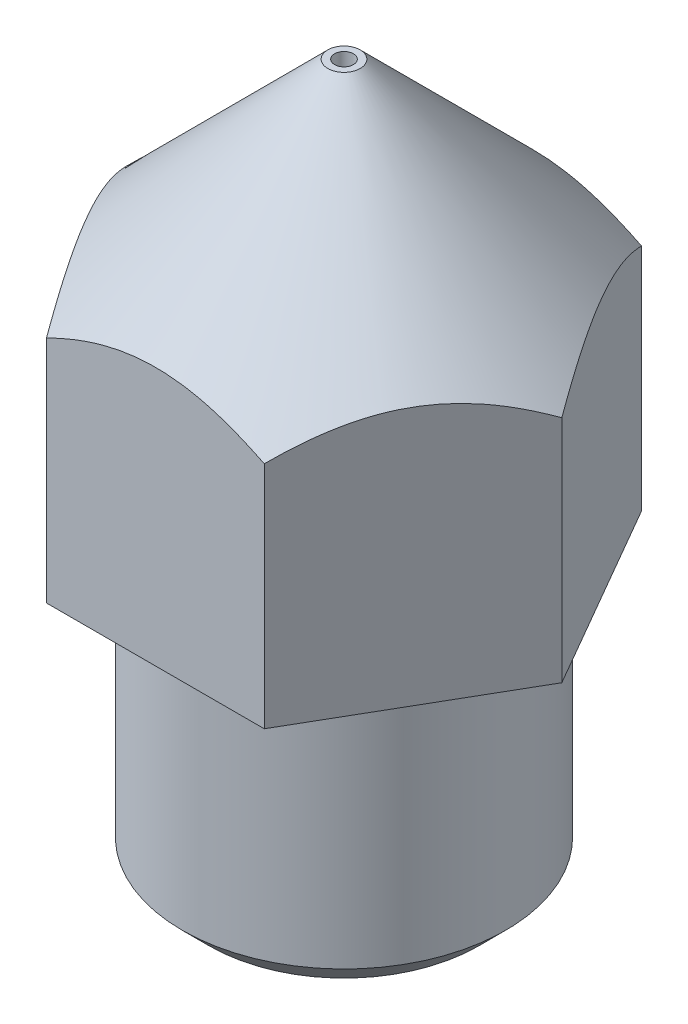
ISO-10303-21;
HEADER;
FILE_DESCRIPTION(('STEP AP214'),'2;1');
FILE_NAME('part.step','',(''),(''),'','','');
FILE_SCHEMA(('AUTOMOTIVE_DESIGN { 1 0 10303 214 1 1 1 1 }'));
ENDSEC;
DATA;
#1=APPLICATION_CONTEXT('core data for automotive mechanical design processes');
#2=APPLICATION_PROTOCOL_DEFINITION('international standard','automotive_design',2000,#1);
#3=PRODUCT_CONTEXT('',#1,'mechanical');
#4=PRODUCT('Part','Part','',(#3));
#5=PRODUCT_RELATED_PRODUCT_CATEGORY('part','',(#4));
#6=PRODUCT_DEFINITION_FORMATION('','',#4);
#7=PRODUCT_DEFINITION_CONTEXT('part definition',#1,'design');
#8=PRODUCT_DEFINITION('design','',#6,#7);
#9=PRODUCT_DEFINITION_SHAPE('','',#8);
#10=(LENGTH_UNIT() NAMED_UNIT(*) SI_UNIT(.MILLI.,.METRE.));
#11=(NAMED_UNIT(*) PLANE_ANGLE_UNIT() SI_UNIT($,.RADIAN.));
#12=(NAMED_UNIT(*) SI_UNIT($,.STERADIAN.) SOLID_ANGLE_UNIT());
#13=UNCERTAINTY_MEASURE_WITH_UNIT(LENGTH_MEASURE(1.E-05),#10,'distance_accuracy_value','');
#14=(GEOMETRIC_REPRESENTATION_CONTEXT(3) GLOBAL_UNCERTAINTY_ASSIGNED_CONTEXT((#13)) GLOBAL_UNIT_ASSIGNED_CONTEXT((#10,
#11,#12)) REPRESENTATION_CONTEXT('',''));
#15=CARTESIAN_POINT('',(0.,0.,0.));
#16=DIRECTION('',(0.,0.,1.));
#17=DIRECTION('',(1.,0.,0.));
#18=AXIS2_PLACEMENT_3D('',#15,#16,#17);
#19=CARTESIAN_POINT('',(0.,13.,0.));
#20=DIRECTION('',(0.,1.,0.));
#21=DIRECTION('',(0.,0.,1.));
#22=AXIS2_PLACEMENT_3D('',#19,#20,#21);
#23=PLANE('',#22);
#24=CARTESIAN_POINT('',(0.,13.,0.));
#25=DIRECTION('',(0.,-1.,0.));
#26=DIRECTION('',(0.,0.,-1.));
#27=AXIS2_PLACEMENT_3D('',#24,#25,#26);
#28=CIRCLE('',#27,0.3);
#29=CARTESIAN_POINT('',(0.,13.,-0.3));
#30=VERTEX_POINT('',#29);
#31=EDGE_CURVE('E196',#30,#30,#28,.T.);
#32=ORIENTED_EDGE('',*,*,#31,.F.);
#33=EDGE_LOOP('',(#32));
#34=FACE_BOUND('',#33,.T.);
#35=CARTESIAN_POINT('',(0.,13.,0.));
#36=DIRECTION('',(0.,1.,0.));
#37=DIRECTION('',(0.,0.,1.));
#38=AXIS2_PLACEMENT_3D('',#35,#36,#37);
#39=CIRCLE('',#38,0.175);
#40=CARTESIAN_POINT('',(0.,13.,0.175));
#41=VERTEX_POINT('',#40);
#42=EDGE_CURVE('E199',#41,#41,#39,.T.);
#43=ORIENTED_EDGE('',*,*,#42,.F.);
#44=EDGE_LOOP('',(#43));
#45=FACE_BOUND('',#44,.T.);
#46=ADVANCED_FACE('F35',(#34,#45),#23,.T.);
#47=CARTESIAN_POINT('',(0.,0.,0.));
#48=DIRECTION('',(0.,1.,0.));
#49=DIRECTION('',(0.,0.,1.));
#50=AXIS2_PLACEMENT_3D('',#47,#48,#49);
#51=PLANE('',#50);
#52=CARTESIAN_POINT('',(0.,0.,0.));
#53=DIRECTION('',(0.,1.,0.));
#54=DIRECTION('',(0.,0.,1.));
#55=AXIS2_PLACEMENT_3D('',#52,#53,#54);
#56=CIRCLE('',#55,2.5);
#57=CARTESIAN_POINT('',(0.,0.,2.5));
#58=VERTEX_POINT('',#57);
#59=EDGE_CURVE('E212',#58,#58,#56,.T.);
#60=ORIENTED_EDGE('',*,*,#59,.F.);
#61=EDGE_LOOP('',(#60));
#62=FACE_BOUND('',#61,.T.);
#63=CARTESIAN_POINT('',(0.,0.,0.));
#64=DIRECTION('',(0.,1.,0.));
#65=DIRECTION('',(0.,0.,1.));
#66=AXIS2_PLACEMENT_3D('',#63,#64,#65);
#67=CIRCLE('',#66,1.25);
#68=CARTESIAN_POINT('',(0.,0.,1.25));
#69=VERTEX_POINT('',#68);
#70=EDGE_CURVE('E209',#69,#69,#67,.T.);
#71=ORIENTED_EDGE('',*,*,#70,.T.);
#72=EDGE_LOOP('',(#71));
#73=FACE_BOUND('',#72,.T.);
#74=ADVANCED_FACE('F187',(#62,#73),#51,.F.);
#75=CARTESIAN_POINT('',(0.,5.,0.));
#76=DIRECTION('',(0.,-1.,0.));
#77=DIRECTION('',(0.,0.,-1.));
#78=AXIS2_PLACEMENT_3D('',#75,#76,#77);
#79=CYLINDRICAL_SURFACE('',#78,3.);
#80=CARTESIAN_POINT('',(0.,5.,0.));
#81=DIRECTION('',(0.,1.,0.));
#82=DIRECTION('',(0.,0.,1.));
#83=AXIS2_PLACEMENT_3D('',#80,#81,#82);
#84=CIRCLE('',#83,3.);
#85=CARTESIAN_POINT('',(0.,5.,3.));
#86=VERTEX_POINT('',#85);
#87=EDGE_CURVE('E11',#86,#86,#84,.T.);
#88=ORIENTED_EDGE('',*,*,#87,.F.);
#89=EDGE_LOOP('',(#88));
#90=FACE_BOUND('',#89,.T.);
#91=CARTESIAN_POINT('',(0.,0.5,0.));
#92=DIRECTION('',(0.,1.,0.));
#93=DIRECTION('',(0.,0.,1.));
#94=AXIS2_PLACEMENT_3D('',#91,#92,#93);
#95=CIRCLE('',#94,3.);
#96=CARTESIAN_POINT('',(0.,0.5,3.));
#97=VERTEX_POINT('',#96);
#98=EDGE_CURVE('E215',#97,#97,#95,.T.);
#99=ORIENTED_EDGE('',*,*,#98,.T.);
#100=EDGE_LOOP('',(#99));
#101=FACE_BOUND('',#100,.T.);
#102=ADVANCED_FACE('F37',(#90,#101),#79,.T.);
#103=CARTESIAN_POINT('',(0.,5.,0.));
#104=DIRECTION('',(0.,1.,0.));
#105=DIRECTION('',(0.,0.,1.));
#106=AXIS2_PLACEMENT_3D('',#103,#104,#105);
#107=PLANE('',#106);
#108=DIRECTION('',(-0.5,0.,-0.866025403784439));
#109=VECTOR('',#108,1.);
#110=CARTESIAN_POINT('',(4.04145188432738,5.,0.));
#111=LINE('',#110,#109);
#112=CARTESIAN_POINT('',(4.04145188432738,5.,0.));
#113=VERTEX_POINT('',#112);
#114=CARTESIAN_POINT('',(2.02072594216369,5.,-3.5));
#115=VERTEX_POINT('',#114);
#116=EDGE_CURVE('E94',#113,#115,#111,.T.);
#117=ORIENTED_EDGE('',*,*,#116,.F.);
#118=DIRECTION('',(0.5,0.,-0.866025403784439));
#119=VECTOR('',#118,1.);
#120=CARTESIAN_POINT('',(2.02072594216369,5.,3.5));
#121=LINE('',#120,#119);
#122=CARTESIAN_POINT('',(2.02072594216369,5.,3.5));
#123=VERTEX_POINT('',#122);
#124=EDGE_CURVE('E115',#123,#113,#121,.T.);
#125=ORIENTED_EDGE('',*,*,#124,.F.);
#126=DIRECTION('',(1.,0.,0.));
#127=VECTOR('',#126,1.);
#128=CARTESIAN_POINT('',(-2.02072594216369,5.,3.5));
#129=LINE('',#128,#127);
#130=CARTESIAN_POINT('',(-2.02072594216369,5.,3.5));
#131=VERTEX_POINT('',#130);
#132=EDGE_CURVE('E117',#131,#123,#129,.T.);
#133=ORIENTED_EDGE('',*,*,#132,.F.);
#134=DIRECTION('',(0.5,0.,0.866025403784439));
#135=VECTOR('',#134,1.);
#136=CARTESIAN_POINT('',(-4.04145188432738,5.,0.));
#137=LINE('',#136,#135);
#138=CARTESIAN_POINT('',(-4.04145188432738,5.,0.));
#139=VERTEX_POINT('',#138);
#140=EDGE_CURVE('E120',#139,#131,#137,.T.);
#141=ORIENTED_EDGE('',*,*,#140,.F.);
#142=DIRECTION('',(-0.5,0.,0.866025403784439));
#143=VECTOR('',#142,1.);
#144=CARTESIAN_POINT('',(-2.02072594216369,5.,-3.5));
#145=LINE('',#144,#143);
#146=CARTESIAN_POINT('',(-2.02072594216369,5.,-3.5));
#147=VERTEX_POINT('',#146);
#148=EDGE_CURVE('E123',#147,#139,#145,.T.);
#149=ORIENTED_EDGE('',*,*,#148,.F.);
#150=DIRECTION('',(-1.,0.,0.));
#151=VECTOR('',#150,1.);
#152=CARTESIAN_POINT('',(2.02072594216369,5.,-3.5));
#153=LINE('',#152,#151);
#154=EDGE_CURVE('E126',#115,#147,#153,.T.);
#155=ORIENTED_EDGE('',*,*,#154,.F.);
#156=EDGE_LOOP('',(#117,#125,#133,#141,#149,#155));
#157=FACE_BOUND('',#156,.T.);
#158=ORIENTED_EDGE('',*,*,#87,.T.);
#159=EDGE_LOOP('',(#158));
#160=FACE_BOUND('',#159,.T.);
#161=ADVANCED_FACE('F185',(#157,#160),#107,.F.);
#162=CARTESIAN_POINT('',(4.04145188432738,13.,0.));
#163=DIRECTION('',(-0.866025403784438,0.,0.5));
#164=DIRECTION('',(0.5,0.,0.866025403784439));
#165=AXIS2_PLACEMENT_3D('',#162,#163,#164);
#166=PLANE('',#165);
#167=DIRECTION('',(0.,-1.,0.));
#168=VECTOR('',#167,1.);
#169=CARTESIAN_POINT('',(2.02072594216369,13.,-3.5));
#170=LINE('',#169,#168);
#171=CARTESIAN_POINT('',(2.02072594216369,9.25854811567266,-3.5));
#172=VERTEX_POINT('',#171);
#173=EDGE_CURVE('E43',#172,#115,#170,.T.);
#174=ORIENTED_EDGE('',*,*,#173,.F.);
#175=CARTESIAN_POINT('',(2.02061047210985,9.25843264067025,-3.5002));
#176=CARTESIAN_POINT('',(2.09007076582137,9.32783218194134,-3.37989124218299));
#177=CARTESIAN_POINT('',(2.16069251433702,9.39315563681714,-3.25757078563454));
#178=CARTESIAN_POINT('',(2.30469791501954,9.51276106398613,-3.00814611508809));
#179=CARTESIAN_POINT('',(2.37809526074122,9.56697649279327,-2.88101818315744));
#180=CARTESIAN_POINT('',(2.52609746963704,9.65984844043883,-2.62467083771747));
#181=CARTESIAN_POINT('',(2.60066464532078,9.69873837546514,-2.49551670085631));
#182=CARTESIAN_POINT('',(2.75144053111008,9.75865621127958,-2.23436520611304));
#183=CARTESIAN_POINT('',(2.82764463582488,9.77972883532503,-2.10237582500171));
#184=CARTESIAN_POINT('',(2.95898000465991,9.79874200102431,-1.87489629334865));
#185=CARTESIAN_POINT('',(3.01394167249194,9.80155641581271,-1.77969989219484));
#186=CARTESIAN_POINT('',(3.12377560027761,9.79681342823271,-1.58946194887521));
#187=CARTESIAN_POINT('',(3.17864782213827,9.78925238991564,-1.49442047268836));
#188=CARTESIAN_POINT('',(3.28787240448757,9.76419021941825,-1.30523794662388));
#189=CARTESIAN_POINT('',(3.3422241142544,9.74667796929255,-1.21109802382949));
#190=CARTESIAN_POINT('',(3.44999406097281,9.70266921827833,-1.02443500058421));
#191=CARTESIAN_POINT('',(3.50341236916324,9.67617340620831,-0.931911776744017));
#192=CARTESIAN_POINT('',(3.59824414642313,9.62166014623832,-0.767658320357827));
#193=CARTESIAN_POINT('',(3.63986754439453,9.59507581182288,-0.695564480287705));
#194=CARTESIAN_POINT('',(3.72236709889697,9.53762274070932,-0.552671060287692));
#195=CARTESIAN_POINT('',(3.76324323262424,9.50675387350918,-0.481871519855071));
#196=CARTESIAN_POINT('',(3.84411947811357,9.44142377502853,-0.341789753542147));
#197=CARTESIAN_POINT('',(3.88412189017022,9.40697384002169,-0.272503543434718));
#198=CARTESIAN_POINT('',(3.96338588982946,9.33493401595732,-0.135214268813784));
#199=CARTESIAN_POINT('',(4.00264791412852,9.29734605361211,-0.0672104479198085));
#200=CARTESIAN_POINT('',(4.04156735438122,9.25843264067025,0.000200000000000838));
#201=B_SPLINE_CURVE_WITH_KNOTS('',3,(#175,#176,#177,#178,#179,#180,#181,#182,#183,#184,#185,
#186,#187,#188,#189,#190,#191,#192,#193,#194,#195,#196,#197,#198,#199,#200),.UNSPECIFIED.,.F.,
.F.,(4,2,2,2,2,2,2,2,2,2,2,2,4),(0.,0.466195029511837,0.93510605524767,1.39657035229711,
1.85687285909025,2.18628459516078,2.51581179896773,2.84570789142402,3.17557869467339,
3.4376213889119,3.69967206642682,3.96091985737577,4.22200840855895),.UNSPECIFIED.);
#202=CARTESIAN_POINT('',(4.04145188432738,9.25854811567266,0.));
#203=VERTEX_POINT('',#202);
#204=EDGE_CURVE('E87',#172,#203,#201,.T.);
#205=ORIENTED_EDGE('',*,*,#204,.T.);
#206=DIRECTION('',(0.,-1.,0.));
#207=VECTOR('',#206,1.);
#208=CARTESIAN_POINT('',(4.04145188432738,13.,0.));
#209=LINE('',#208,#207);
#210=EDGE_CURVE('E58',#203,#113,#209,.T.);
#211=ORIENTED_EDGE('',*,*,#210,.T.);
#212=ORIENTED_EDGE('',*,*,#116,.T.);
#213=EDGE_LOOP('',(#174,#205,#211,#212));
#214=FACE_BOUND('',#213,.T.);
#215=ADVANCED_FACE('F104',(#214),#166,.F.);
#216=CARTESIAN_POINT('',(2.02072594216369,13.,-3.5));
#217=DIRECTION('',(0.,0.,1.));
#218=DIRECTION('',(1.,0.,0.));
#219=AXIS2_PLACEMENT_3D('',#216,#217,#218);
#220=PLANE('',#219);
#221=DIRECTION('',(0.,-1.,0.));
#222=VECTOR('',#221,1.);
#223=CARTESIAN_POINT('',(-2.02072594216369,13.,-3.5));
#224=LINE('',#223,#222);
#225=CARTESIAN_POINT('',(-2.02072594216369,9.25854811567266,-3.5));
#226=VERTEX_POINT('',#225);
#227=EDGE_CURVE('E101',#226,#147,#224,.T.);
#228=ORIENTED_EDGE('',*,*,#227,.F.);
#229=CARTESIAN_POINT('',(-4.05974024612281,7.9398236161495,-3.5));
#230=CARTESIAN_POINT('',(-3.96102227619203,8.01457458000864,-3.5));
#231=CARTESIAN_POINT('',(-3.861754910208,8.08861173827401,-3.5));
#232=CARTESIAN_POINT('',(-3.6619033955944,8.2349377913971,-3.5));
#233=CARTESIAN_POINT('',(-3.56131892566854,8.30722624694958,-3.5));
#234=CARTESIAN_POINT('',(-3.35787936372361,8.45024842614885,-3.5));
#235=CARTESIAN_POINT('',(-3.25501271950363,8.52096577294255,-3.5));
#236=CARTESIAN_POINT('',(-3.04753856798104,8.65979048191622,-3.5));
#237=CARTESIAN_POINT('',(-2.94293118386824,8.72789802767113,-3.5));
#238=CARTESIAN_POINT('',(-2.72555527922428,8.86478741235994,-3.5));
#239=CARTESIAN_POINT('',(-2.61266586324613,8.93337824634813,-3.5));
#240=CARTESIAN_POINT('',(-2.38424886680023,9.06608939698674,-3.5));
#241=CARTESIAN_POINT('',(-2.26872086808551,9.13020899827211,-3.5));
#242=CARTESIAN_POINT('',(-2.03503065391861,9.25259701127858,-3.5));
#243=CARTESIAN_POINT('',(-1.91687751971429,9.31088262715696,-3.5));
#244=CARTESIAN_POINT('',(-1.67732949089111,9.42029763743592,-3.5));
#245=CARTESIAN_POINT('',(-1.55593610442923,9.47143029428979,-3.5));
#246=CARTESIAN_POINT('',(-1.31999119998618,9.56081801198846,-3.5));
#247=CARTESIAN_POINT('',(-1.20571483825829,9.59979186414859,-3.5));
#248=CARTESIAN_POINT('',(-0.974384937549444,9.66857564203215,-3.5));
#249=CARTESIAN_POINT('',(-0.857331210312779,9.69838494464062,-3.5));
#250=CARTESIAN_POINT('',(-0.623106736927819,9.74677811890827,-3.5));
#251=CARTESIAN_POINT('',(-0.505976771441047,9.76555613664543,-3.5));
#252=CARTESIAN_POINT('',(-0.270432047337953,9.7915175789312,-3.5));
#253=CARTESIAN_POINT('',(-0.152017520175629,9.79870305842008,-3.5));
#254=CARTESIAN_POINT('',(0.0805018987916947,9.8009330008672,-3.5));
#255=CARTESIAN_POINT('',(0.194602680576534,9.79642060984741,-3.5));
#256=CARTESIAN_POINT('',(0.421841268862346,9.77648873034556,-3.5));
#257=CARTESIAN_POINT('',(0.534978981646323,9.76106819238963,-3.5));
#258=CARTESIAN_POINT('',(0.761385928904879,9.71990393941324,-3.5));
#259=CARTESIAN_POINT('',(0.874622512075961,9.6939835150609,-3.5));
#260=CARTESIAN_POINT('',(1.09862460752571,9.63321068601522,-3.5));
#261=CARTESIAN_POINT('',(1.20939031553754,9.59835899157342,-3.5));
#262=CARTESIAN_POINT('',(1.43782078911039,9.51781544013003,-3.5));
#263=CARTESIAN_POINT('',(1.55524294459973,9.47144257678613,-3.5));
#264=CARTESIAN_POINT('',(1.78702734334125,9.37157536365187,-3.5));
#265=CARTESIAN_POINT('',(1.90138855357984,9.31807864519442,-3.5));
#266=CARTESIAN_POINT('',(2.12762999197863,9.20522708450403,-3.5));
#267=CARTESIAN_POINT('',(2.23950081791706,9.14585354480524,-3.5));
#268=CARTESIAN_POINT('',(2.46067005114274,9.02256260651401,-3.5));
#269=CARTESIAN_POINT('',(2.56996886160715,8.95864592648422,-3.5));
#270=CARTESIAN_POINT('',(2.78095980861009,8.83042795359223,-3.5));
#271=CARTESIAN_POINT('',(2.8827600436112,8.7663036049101,-3.5));
#272=CARTESIAN_POINT('',(3.08461256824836,8.63535220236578,-3.5));
#273=CARTESIAN_POINT('',(3.18466472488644,8.56852494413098,-3.5));
#274=CARTESIAN_POINT('',(3.38243971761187,8.43320122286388,-3.5));
#275=CARTESIAN_POINT('',(3.48017486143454,8.36472268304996,-3.5));
#276=CARTESIAN_POINT('',(3.67430850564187,8.22595005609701,-3.5));
#277=CARTESIAN_POINT('',(3.77070736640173,8.15565647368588,-3.5));
#278=CARTESIAN_POINT('',(3.86654647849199,8.08462065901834,-3.5));
#279=B_SPLINE_CURVE_WITH_KNOTS('',3,(#229,#230,#231,#232,#233,#234,#235,#236,#237,#238,#239,
#240,#241,#242,#243,#244,#245,#246,#247,#248,#249,#250,#251,#252,#253,#254,#255,#256,#257,#258,
#259,#260,#261,#262,#263,#264,#265,#266,#267,#268,#269,#270,#271,#272,#273,#274,#275,#276,#277,
#278),.UNSPECIFIED.,.F.,.F.,(4,2,2,2,2,2,2,2,2,2,2,2,2,2,2,2,2,2,2,2,2,2,2,2,4),(0.,
0.371486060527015,0.743064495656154,1.11752069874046,1.49195051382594,1.88814901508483,
2.284410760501,2.67946720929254,3.0743428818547,3.4362444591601,3.79817063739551,
4.1535198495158,4.50880606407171,4.85083143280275,5.19288971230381,5.5409611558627,
5.88900492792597,6.2674530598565,6.64602734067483,7.02584735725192,7.40560743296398,
7.76649630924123,8.12741252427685,8.48540294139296,8.84329485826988),.UNSPECIFIED.);
#280=EDGE_CURVE('E90',#226,#172,#279,.T.);
#281=ORIENTED_EDGE('',*,*,#280,.T.);
#282=ORIENTED_EDGE('',*,*,#173,.T.);
#283=ORIENTED_EDGE('',*,*,#154,.T.);
#284=EDGE_LOOP('',(#228,#281,#282,#283));
#285=FACE_BOUND('',#284,.T.);
#286=ADVANCED_FACE('F98',(#285),#220,.F.);
#287=CARTESIAN_POINT('',(-2.02072594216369,13.,-3.5));
#288=DIRECTION('',(0.866025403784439,0.,0.5));
#289=DIRECTION('',(0.5,0.,-0.866025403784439));
#290=AXIS2_PLACEMENT_3D('',#287,#288,#289);
#291=PLANE('',#290);
#292=DIRECTION('',(0.,-1.,0.));
#293=VECTOR('',#292,1.);
#294=CARTESIAN_POINT('',(-4.04145188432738,13.,0.));
#295=LINE('',#294,#293);
#296=CARTESIAN_POINT('',(-4.04145188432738,9.25854811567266,0.));
#297=VERTEX_POINT('',#296);
#298=EDGE_CURVE('E106',#297,#139,#295,.T.);
#299=ORIENTED_EDGE('',*,*,#298,.F.);
#300=CARTESIAN_POINT('',(-4.04156735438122,9.25843264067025,0.000199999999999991));
#301=CARTESIAN_POINT('',(-3.9721070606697,9.32783218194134,-0.12010875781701));
#302=CARTESIAN_POINT('',(-3.90148531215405,9.39315563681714,-0.24242921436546));
#303=CARTESIAN_POINT('',(-3.75747991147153,9.51276106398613,-0.49185388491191));
#304=CARTESIAN_POINT('',(-3.68408256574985,9.56697649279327,-0.618981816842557));
#305=CARTESIAN_POINT('',(-3.53608035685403,9.65984844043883,-0.875329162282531));
#306=CARTESIAN_POINT('',(-3.46151318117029,9.69873837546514,-1.00448329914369));
#307=CARTESIAN_POINT('',(-3.31073729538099,9.75865621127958,-1.26563479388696));
#308=CARTESIAN_POINT('',(-3.23453319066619,9.77972883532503,-1.39762417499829));
#309=CARTESIAN_POINT('',(-3.10319782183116,9.79874200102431,-1.62510370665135));
#310=CARTESIAN_POINT('',(-3.04823615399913,9.80155641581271,-1.72030010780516));
#311=CARTESIAN_POINT('',(-2.93840222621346,9.79681342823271,-1.91053805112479));
#312=CARTESIAN_POINT('',(-2.88353000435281,9.78925238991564,-2.00557952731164));
#313=CARTESIAN_POINT('',(-2.77430542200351,9.76419021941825,-2.19476205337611));
#314=CARTESIAN_POINT('',(-2.71995371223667,9.74667796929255,-2.28890197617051));
#315=CARTESIAN_POINT('',(-2.61218376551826,9.70266921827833,-2.47556499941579));
#316=CARTESIAN_POINT('',(-2.55876545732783,9.6761734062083,-2.56808822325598));
#317=CARTESIAN_POINT('',(-2.46393368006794,9.62166014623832,-2.73234167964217));
#318=CARTESIAN_POINT('',(-2.42231028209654,9.59507581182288,-2.8044355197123));
#319=CARTESIAN_POINT('',(-2.33981072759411,9.53762274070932,-2.94732893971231));
#320=CARTESIAN_POINT('',(-2.29893459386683,9.50675387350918,-3.01812848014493));
#321=CARTESIAN_POINT('',(-2.21805834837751,9.44142377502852,-3.15821024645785));
#322=CARTESIAN_POINT('',(-2.17805593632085,9.40697384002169,-3.22749645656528));
#323=CARTESIAN_POINT('',(-2.09879193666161,9.33493401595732,-3.36478573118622));
#324=CARTESIAN_POINT('',(-2.05952991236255,9.29734605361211,-3.43278955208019));
#325=CARTESIAN_POINT('',(-2.02061047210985,9.25843264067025,-3.5002));
#326=B_SPLINE_CURVE_WITH_KNOTS('',3,(#300,#301,#302,#303,#304,#305,#306,#307,#308,#309,#310,
#311,#312,#313,#314,#315,#316,#317,#318,#319,#320,#321,#322,#323,#324,#325),.UNSPECIFIED.,.F.,
.F.,(4,2,2,2,2,2,2,2,2,2,2,2,4),(0.,0.466195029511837,0.935106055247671,1.39657035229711,
1.85687285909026,2.18628459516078,2.51581179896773,2.84570789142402,3.17557869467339,
3.4376213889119,3.69967206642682,3.96091985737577,4.22200840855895),.UNSPECIFIED.);
#327=EDGE_CURVE('E102',#297,#226,#326,.T.);
#328=ORIENTED_EDGE('',*,*,#327,.T.);
#329=ORIENTED_EDGE('',*,*,#227,.T.);
#330=ORIENTED_EDGE('',*,*,#148,.T.);
#331=EDGE_LOOP('',(#299,#328,#329,#330));
#332=FACE_BOUND('',#331,.T.);
#333=ADVANCED_FACE('F174',(#332),#291,.F.);
#334=CARTESIAN_POINT('',(-4.04145188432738,13.,0.));
#335=DIRECTION('',(0.866025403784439,0.,-0.5));
#336=DIRECTION('',(-0.5,0.,-0.866025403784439));
#337=AXIS2_PLACEMENT_3D('',#334,#335,#336);
#338=PLANE('',#337);
#339=DIRECTION('',(0.,-1.,0.));
#340=VECTOR('',#339,1.);
#341=CARTESIAN_POINT('',(-2.02072594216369,13.,3.5));
#342=LINE('',#341,#340);
#343=CARTESIAN_POINT('',(-2.02072594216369,9.25854811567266,3.5));
#344=VERTEX_POINT('',#343);
#345=EDGE_CURVE('E110',#344,#131,#342,.T.);
#346=ORIENTED_EDGE('',*,*,#345,.F.);
#347=CARTESIAN_POINT('',(-2.02061047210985,9.25843264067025,3.5002));
#348=CARTESIAN_POINT('',(-2.09007076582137,9.32783218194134,3.37989124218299));
#349=CARTESIAN_POINT('',(-2.16069251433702,9.39315563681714,3.25757078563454));
#350=CARTESIAN_POINT('',(-2.30469791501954,9.51276106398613,3.00814611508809));
#351=CARTESIAN_POINT('',(-2.37809526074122,9.56697649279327,2.88101818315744));
#352=CARTESIAN_POINT('',(-2.52609746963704,9.65984844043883,2.62467083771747));
#353=CARTESIAN_POINT('',(-2.60066464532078,9.69873837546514,2.49551670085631));
#354=CARTESIAN_POINT('',(-2.75144053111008,9.75865621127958,2.23436520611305));
#355=CARTESIAN_POINT('',(-2.82764463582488,9.77972883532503,2.10237582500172));
#356=CARTESIAN_POINT('',(-2.95898000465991,9.79874200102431,1.87489629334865));
#357=CARTESIAN_POINT('',(-3.01394167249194,9.80155641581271,1.77969989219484));
#358=CARTESIAN_POINT('',(-3.12377560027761,9.79681342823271,1.58946194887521));
#359=CARTESIAN_POINT('',(-3.17864782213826,9.78925238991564,1.49442047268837));
#360=CARTESIAN_POINT('',(-3.28787240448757,9.76419021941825,1.30523794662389));
#361=CARTESIAN_POINT('',(-3.3422241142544,9.74667796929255,1.21109802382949));
#362=CARTESIAN_POINT('',(-3.44999406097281,9.70266921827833,1.02443500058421));
#363=CARTESIAN_POINT('',(-3.50341236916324,9.6761734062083,0.93191177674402));
#364=CARTESIAN_POINT('',(-3.59824414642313,9.62166014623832,0.767658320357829));
#365=CARTESIAN_POINT('',(-3.63986754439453,9.59507581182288,0.695564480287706));
#366=CARTESIAN_POINT('',(-3.72236709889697,9.53762274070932,0.552671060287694));
#367=CARTESIAN_POINT('',(-3.76324323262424,9.50675387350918,0.481871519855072));
#368=CARTESIAN_POINT('',(-3.84411947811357,9.44142377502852,0.341789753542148));
#369=CARTESIAN_POINT('',(-3.88412189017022,9.40697384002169,0.27250354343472));
#370=CARTESIAN_POINT('',(-3.96338588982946,9.33493401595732,0.135214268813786));
#371=CARTESIAN_POINT('',(-4.00264791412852,9.29734605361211,0.0672104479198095));
#372=CARTESIAN_POINT('',(-4.04156735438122,9.25843264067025,-0.00020000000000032));
#373=B_SPLINE_CURVE_WITH_KNOTS('',3,(#347,#348,#349,#350,#351,#352,#353,#354,#355,#356,#357,
#358,#359,#360,#361,#362,#363,#364,#365,#366,#367,#368,#369,#370,#371,#372),.UNSPECIFIED.,.F.,
.F.,(4,2,2,2,2,2,2,2,2,2,2,2,4),(0.,0.466195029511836,0.93510605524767,1.3965703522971,
1.85687285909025,2.18628459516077,2.51581179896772,2.84570789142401,3.17557869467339,
3.4376213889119,3.69967206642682,3.96091985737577,4.22200840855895),.UNSPECIFIED.);
#374=EDGE_CURVE('E165',#344,#297,#373,.T.);
#375=ORIENTED_EDGE('',*,*,#374,.T.);
#376=ORIENTED_EDGE('',*,*,#298,.T.);
#377=ORIENTED_EDGE('',*,*,#140,.T.);
#378=EDGE_LOOP('',(#346,#375,#376,#377));
#379=FACE_BOUND('',#378,.T.);
#380=ADVANCED_FACE('F177',(#379),#338,.F.);
#381=CARTESIAN_POINT('',(-2.02072594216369,13.,3.5));
#382=DIRECTION('',(0.,0.,-1.));
#383=DIRECTION('',(-1.,0.,0.));
#384=AXIS2_PLACEMENT_3D('',#381,#382,#383);
#385=PLANE('',#384);
#386=DIRECTION('',(0.,-1.,0.));
#387=VECTOR('',#386,1.);
#388=CARTESIAN_POINT('',(2.02072594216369,13.,3.5));
#389=LINE('',#388,#387);
#390=CARTESIAN_POINT('',(2.02072594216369,9.25854811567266,3.5));
#391=VERTEX_POINT('',#390);
#392=EDGE_CURVE('E112',#391,#123,#389,.T.);
#393=ORIENTED_EDGE('',*,*,#392,.F.);
#394=CARTESIAN_POINT('',(-4.05974024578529,7.93982361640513,3.5));
#395=CARTESIAN_POINT('',(-3.96102227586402,8.01457458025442,3.5));
#396=CARTESIAN_POINT('',(-3.86175490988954,8.08861173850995,3.5));
#397=CARTESIAN_POINT('',(-3.66190339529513,8.23493779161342,3.5));
#398=CARTESIAN_POINT('',(-3.56131892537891,8.30722624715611,3.5));
#399=CARTESIAN_POINT('',(-3.35787936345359,8.45024842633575,3.5));
#400=CARTESIAN_POINT('',(-3.25501271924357,8.5209657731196,3.5));
#401=CARTESIAN_POINT('',(-3.0475385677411,8.65979048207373,3.5));
#402=CARTESIAN_POINT('',(-2.94293118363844,8.72789802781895,3.5));
#403=CARTESIAN_POINT('',(-2.72555527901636,8.86478741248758,3.5));
#404=CARTESIAN_POINT('',(-2.61266586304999,8.93337824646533,3.5));
#405=CARTESIAN_POINT('',(-2.38424886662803,9.06608939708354,3.5));
#406=CARTESIAN_POINT('',(-2.26872086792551,9.13020899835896,3.5));
#407=CARTESIAN_POINT('',(-2.03503065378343,9.25259701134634,3.5));
#408=CARTESIAN_POINT('',(-1.91687751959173,9.31088262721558,3.5));
#409=CARTESIAN_POINT('',(-1.67732949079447,9.42029763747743,3.5));
#410=CARTESIAN_POINT('',(-1.5559361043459,9.4714302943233,3.5));
#411=CARTESIAN_POINT('',(-1.31999119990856,9.56081801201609,3.5));
#412=CARTESIAN_POINT('',(-1.2057148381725,9.59979186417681,3.5));
#413=CARTESIAN_POINT('',(-0.974384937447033,9.6685756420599,3.5));
#414=CARTESIAN_POINT('',(-0.857331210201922,9.69838494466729,3.5));
#415=CARTESIAN_POINT('',(-0.623106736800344,9.7467781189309,3.5));
#416=CARTESIAN_POINT('',(-0.505976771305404,9.76555613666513,3.5));
#417=CARTESIAN_POINT('',(-0.27043204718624,9.79151757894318,3.5));
#418=CARTESIAN_POINT('',(-0.152017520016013,9.79870305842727,3.5));
#419=CARTESIAN_POINT('',(0.0805018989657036,9.80093300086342,3.5));
#420=CARTESIAN_POINT('',(0.194602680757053,9.79642060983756,3.5));
#421=CARTESIAN_POINT('',(0.421841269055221,9.77648873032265,3.5));
#422=CARTESIAN_POINT('',(0.534978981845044,9.76106819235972,3.5));
#423=CARTESIAN_POINT('',(0.761385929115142,9.71990393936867,3.5));
#424=CARTESIAN_POINT('',(0.874622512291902,9.69398351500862,3.5));
#425=CARTESIAN_POINT('',(1.09862460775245,9.63321068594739,3.5));
#426=CARTESIAN_POINT('',(1.2093903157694,9.59835899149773,3.5));
#427=CARTESIAN_POINT('',(1.43782078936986,9.51781544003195,3.5));
#428=CARTESIAN_POINT('',(1.55524294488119,9.47144257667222,3.5));
#429=CARTESIAN_POINT('',(1.78702734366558,9.37157536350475,3.5));
#430=CARTESIAN_POINT('',(1.90138855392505,9.31807864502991,3.5));
#431=CARTESIAN_POINT('',(2.12762999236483,9.20522708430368,3.5));
#432=CARTESIAN_POINT('',(2.23950081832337,9.14585354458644,3.5));
#433=CARTESIAN_POINT('',(2.46067005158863,9.02256260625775,3.5));
#434=CARTESIAN_POINT('',(2.56996886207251,8.95864592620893,3.5));
#435=CARTESIAN_POINT('',(2.78095980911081,8.83042795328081,3.5));
#436=CARTESIAN_POINT('',(2.88276004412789,8.76630360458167,3.5));
#437=CARTESIAN_POINT('',(3.08461256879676,8.63535220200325,3.5));
#438=CARTESIAN_POINT('',(3.18466472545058,8.56852494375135,3.5));
#439=CARTESIAN_POINT('',(3.38243971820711,8.43320122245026,3.5));
#440=CARTESIAN_POINT('',(3.48017486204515,8.36472268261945,3.5));
#441=CARTESIAN_POINT('',(3.6743085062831,8.22595005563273,3.5));
#442=CARTESIAN_POINT('',(3.77070736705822,8.15565647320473,3.5));
#443=CARTESIAN_POINT('',(3.86654647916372,8.08462065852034,3.5));
#444=B_SPLINE_CURVE_WITH_KNOTS('',3,(#394,#395,#396,#397,#398,#399,#400,#401,#402,#403,#404,
#405,#406,#407,#408,#409,#410,#411,#412,#413,#414,#415,#416,#417,#418,#419,#420,#421,#422,#423,
#424,#425,#426,#427,#428,#429,#430,#431,#432,#433,#434,#435,#436,#437,#438,#439,#440,#441,#442,
#443),.UNSPECIFIED.,.F.,.F.,(4,2,2,2,2,2,2,2,2,2,2,2,2,2,2,2,2,2,2,2,2,2,2,2,4),(0.,
0.371486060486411,0.743064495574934,1.11752069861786,1.49195051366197,1.88814901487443,
2.28441076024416,2.67946720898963,3.07434288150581,3.43624445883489,3.79817063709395,
4.1535198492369,4.50880606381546,4.85083143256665,5.19288971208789,5.54096115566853,
5.88900492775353,6.26745305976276,6.64602734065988,7.0258473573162,7.40560743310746,
7.76649630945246,8.12741252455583,8.48540294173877,8.84329485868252),.UNSPECIFIED.);
#445=EDGE_CURVE('E50',#391,#344,#444,.F.);
#446=ORIENTED_EDGE('',*,*,#445,.T.);
#447=ORIENTED_EDGE('',*,*,#345,.T.);
#448=ORIENTED_EDGE('',*,*,#132,.T.);
#449=EDGE_LOOP('',(#393,#446,#447,#448));
#450=FACE_BOUND('',#449,.T.);
#451=ADVANCED_FACE('F230',(#450),#385,.F.);
#452=CARTESIAN_POINT('',(2.02072594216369,13.,3.5));
#453=DIRECTION('',(-0.866025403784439,0.,-0.5));
#454=DIRECTION('',(-0.5,0.,0.866025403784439));
#455=AXIS2_PLACEMENT_3D('',#452,#453,#454);
#456=PLANE('',#455);
#457=ORIENTED_EDGE('',*,*,#210,.F.);
#458=CARTESIAN_POINT('',(4.04156735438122,9.25843264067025,-0.000199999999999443));
#459=CARTESIAN_POINT('',(3.9721070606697,9.32783218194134,0.120108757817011));
#460=CARTESIAN_POINT('',(3.90148531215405,9.39315563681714,0.242429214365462));
#461=CARTESIAN_POINT('',(3.75747991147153,9.51276106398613,0.491853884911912));
#462=CARTESIAN_POINT('',(3.68408256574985,9.56697649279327,0.618981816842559));
#463=CARTESIAN_POINT('',(3.53608035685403,9.65984844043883,0.875329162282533));
#464=CARTESIAN_POINT('',(3.46151318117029,9.69873837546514,1.00448329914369));
#465=CARTESIAN_POINT('',(3.31073729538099,9.75865621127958,1.26563479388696));
#466=CARTESIAN_POINT('',(3.23453319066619,9.77972883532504,1.39762417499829));
#467=CARTESIAN_POINT('',(3.10319782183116,9.79874200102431,1.62510370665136));
#468=CARTESIAN_POINT('',(3.04823615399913,9.80155641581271,1.72030010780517));
#469=CARTESIAN_POINT('',(2.93840222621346,9.79681342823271,1.9105380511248));
#470=CARTESIAN_POINT('',(2.8835300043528,9.78925238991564,2.00557952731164));
#471=CARTESIAN_POINT('',(2.7743054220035,9.76419021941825,2.19476205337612));
#472=CARTESIAN_POINT('',(2.71995371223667,9.74667796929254,2.28890197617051));
#473=CARTESIAN_POINT('',(2.61218376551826,9.70266921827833,2.47556499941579));
#474=CARTESIAN_POINT('',(2.55876545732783,9.6761734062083,2.56808822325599));
#475=CARTESIAN_POINT('',(2.46393368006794,9.62166014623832,2.73234167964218));
#476=CARTESIAN_POINT('',(2.42231028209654,9.59507581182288,2.8044355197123));
#477=CARTESIAN_POINT('',(2.3398107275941,9.53762274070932,2.94732893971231));
#478=CARTESIAN_POINT('',(2.29893459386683,9.50675387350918,3.01812848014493));
#479=CARTESIAN_POINT('',(2.2180583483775,9.44142377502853,3.15821024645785));
#480=CARTESIAN_POINT('',(2.17805593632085,9.40697384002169,3.22749645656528));
#481=CARTESIAN_POINT('',(2.09879193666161,9.33493401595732,3.36478573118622));
#482=CARTESIAN_POINT('',(2.05952991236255,9.29734605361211,3.43278955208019));
#483=CARTESIAN_POINT('',(2.02061047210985,9.25843264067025,3.5002));
#484=B_SPLINE_CURVE_WITH_KNOTS('',3,(#458,#459,#460,#461,#462,#463,#464,#465,#466,#467,#468,
#469,#470,#471,#472,#473,#474,#475,#476,#477,#478,#479,#480,#481,#482,#483),.UNSPECIFIED.,.F.,
.F.,(4,2,2,2,2,2,2,2,2,2,2,2,4),(0.,0.466195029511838,0.935106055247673,1.39657035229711,
1.85687285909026,2.18628459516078,2.51581179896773,2.84570789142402,3.1755786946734,
3.43762138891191,3.69967206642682,3.96091985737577,4.22200840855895),.UNSPECIFIED.);
#485=EDGE_CURVE('E92',#203,#391,#484,.T.);
#486=ORIENTED_EDGE('',*,*,#485,.T.);
#487=ORIENTED_EDGE('',*,*,#392,.T.);
#488=ORIENTED_EDGE('',*,*,#124,.T.);
#489=EDGE_LOOP('',(#457,#486,#487,#488));
#490=FACE_BOUND('',#489,.T.);
#491=ADVANCED_FACE('F144',(#490),#456,.F.);
#492=CARTESIAN_POINT('',(0.,13.,0.));
#493=DIRECTION('',(0.,-1.,0.));
#494=DIRECTION('',(0.,0.,-1.));
#495=AXIS2_PLACEMENT_3D('',#492,#493,#494);
#496=CONICAL_SURFACE('',#495,0.3,0.785398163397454);
#497=ORIENTED_EDGE('',*,*,#31,.T.);
#498=EDGE_LOOP('',(#497));
#499=FACE_BOUND('',#498,.T.);
#500=ORIENTED_EDGE('',*,*,#280,.F.);
#501=ORIENTED_EDGE('',*,*,#327,.F.);
#502=ORIENTED_EDGE('',*,*,#374,.F.);
#503=ORIENTED_EDGE('',*,*,#445,.F.);
#504=ORIENTED_EDGE('',*,*,#485,.F.);
#505=ORIENTED_EDGE('',*,*,#204,.F.);
#506=EDGE_LOOP('',(#500,#501,#502,#503,#504,#505));
#507=FACE_BOUND('',#506,.T.);
#508=ADVANCED_FACE('F89',(#499,#507),#496,.T.);
#509=CARTESIAN_POINT('',(0.,0.5,0.));
#510=DIRECTION('',(0.,1.,0.));
#511=DIRECTION('',(0.,0.,1.));
#512=AXIS2_PLACEMENT_3D('',#509,#510,#511);
#513=CONICAL_SURFACE('',#512,3.,0.785398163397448);
#514=ORIENTED_EDGE('',*,*,#59,.T.);
#515=EDGE_LOOP('',(#514));
#516=FACE_BOUND('',#515,.T.);
#517=ORIENTED_EDGE('',*,*,#98,.F.);
#518=EDGE_LOOP('',(#517));
#519=FACE_BOUND('',#518,.T.);
#520=ADVANCED_FACE('F143',(#516,#519),#513,.T.);
#521=CARTESIAN_POINT('',(0.,13.,0.));
#522=DIRECTION('',(0.,1.,0.));
#523=DIRECTION('',(0.,0.,1.));
#524=AXIS2_PLACEMENT_3D('',#521,#522,#523);
#525=CYLINDRICAL_SURFACE('',#524,1.25);
#526=CARTESIAN_POINT('',(0.,10.6380453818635,0.));
#527=DIRECTION('',(0.,1.,0.));
#528=DIRECTION('',(0.,0.,1.));
#529=AXIS2_PLACEMENT_3D('',#526,#527,#528);
#530=CIRCLE('',#529,1.25);
#531=CARTESIAN_POINT('',(0.,10.6380453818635,-1.25));
#532=VERTEX_POINT('',#531);
#533=EDGE_CURVE('E204',#532,#532,#530,.T.);
#534=ORIENTED_EDGE('',*,*,#533,.T.);
#535=EDGE_LOOP('',(#534));
#536=FACE_BOUND('',#535,.T.);
#537=ORIENTED_EDGE('',*,*,#70,.F.);
#538=EDGE_LOOP('',(#537));
#539=FACE_BOUND('',#538,.T.);
#540=ADVANCED_FACE('F249',(#536,#539),#525,.F.);
#541=CARTESIAN_POINT('',(0.,10.6380453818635,0.));
#542=DIRECTION('',(0.,-1.,0.));
#543=DIRECTION('',(0.,0.,-1.));
#544=AXIS2_PLACEMENT_3D('',#541,#542,#543);
#545=CONICAL_SURFACE('',#544,1.25,0.523598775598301);
#546=CARTESIAN_POINT('',(0.,12.5,0.));
#547=DIRECTION('',(0.,1.,0.));
#548=DIRECTION('',(0.,0.,1.));
#549=AXIS2_PLACEMENT_3D('',#546,#547,#548);
#550=CIRCLE('',#549,0.175);
#551=CARTESIAN_POINT('',(0.,12.5,-0.175));
#552=VERTEX_POINT('',#551);
#553=EDGE_CURVE('E201',#552,#552,#550,.T.);
#554=CARTESIAN_POINT('',(0.,12.5,-0.175));
#555=CARTESIAN_POINT('',(0.,12.4806046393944,-0.186197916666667));
#556=CARTESIAN_POINT('',(0.,12.4612092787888,-0.197395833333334));
#557=CARTESIAN_POINT('',(0.,12.4224185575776,-0.219791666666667));
#558=CARTESIAN_POINT('',(0.,12.4030231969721,-0.230989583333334));
#559=CARTESIAN_POINT('',(0.,12.3642324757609,-0.253385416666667));
#560=CARTESIAN_POINT('',(0.,12.3448371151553,-0.264583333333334));
#561=CARTESIAN_POINT('',(0.,12.3060463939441,-0.286979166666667));
#562=CARTESIAN_POINT('',(0.,12.2866510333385,-0.298177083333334));
#563=CARTESIAN_POINT('',(0.,12.2478603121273,-0.320572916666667));
#564=CARTESIAN_POINT('',(0.,12.2284649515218,-0.331770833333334));
#565=CARTESIAN_POINT('',(0.,12.1896742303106,-0.354166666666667));
#566=CARTESIAN_POINT('',(0.,12.170278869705,-0.365364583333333));
#567=CARTESIAN_POINT('',(0.,12.1314881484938,-0.387760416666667));
#568=CARTESIAN_POINT('',(0.,12.1120927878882,-0.398958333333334));
#569=CARTESIAN_POINT('',(0.,12.073302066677,-0.421354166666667));
#570=CARTESIAN_POINT('',(0.,12.0539067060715,-0.432552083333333));
#571=CARTESIAN_POINT('',(0.,12.0151159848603,-0.454947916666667));
#572=CARTESIAN_POINT('',(0.,11.9957206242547,-0.466145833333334));
#573=CARTESIAN_POINT('',(0.,11.9569299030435,-0.488541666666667));
#574=CARTESIAN_POINT('',(0.,11.9375345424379,-0.499739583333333));
#575=CARTESIAN_POINT('',(0.,11.8987438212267,-0.522135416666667));
#576=CARTESIAN_POINT('',(0.,11.8793484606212,-0.533333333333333));
#577=CARTESIAN_POINT('',(0.,11.84055773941,-0.555729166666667));
#578=CARTESIAN_POINT('',(0.,11.8211623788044,-0.566927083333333));
#579=CARTESIAN_POINT('',(0.,11.7823716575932,-0.589322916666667));
#580=CARTESIAN_POINT('',(0.,11.7629762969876,-0.600520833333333));
#581=CARTESIAN_POINT('',(0.,11.7241855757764,-0.622916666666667));
#582=CARTESIAN_POINT('',(0.,11.7047902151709,-0.634114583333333));
#583=CARTESIAN_POINT('',(0.,11.6659994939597,-0.656510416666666));
#584=CARTESIAN_POINT('',(0.,11.6466041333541,-0.667708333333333));
#585=CARTESIAN_POINT('',(0.,11.6078134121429,-0.690104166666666));
#586=CARTESIAN_POINT('',(0.,11.5884180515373,-0.701302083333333));
#587=CARTESIAN_POINT('',(0.,11.5496273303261,-0.723697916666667));
#588=CARTESIAN_POINT('',(0.,11.5302319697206,-0.734895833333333));
#589=CARTESIAN_POINT('',(0.,11.4914412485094,-0.757291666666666));
#590=CARTESIAN_POINT('',(0.,11.4720458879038,-0.768489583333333));
#591=CARTESIAN_POINT('',(0.,11.4332551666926,-0.790885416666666));
#592=CARTESIAN_POINT('',(0.,11.413859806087,-0.802083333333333));
#593=CARTESIAN_POINT('',(0.,11.3750690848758,-0.824479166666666));
#594=CARTESIAN_POINT('',(0.,11.3556737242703,-0.835677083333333));
#595=CARTESIAN_POINT('',(0.,11.3168830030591,-0.858072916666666));
#596=CARTESIAN_POINT('',(0.,11.2974876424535,-0.869270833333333));
#597=CARTESIAN_POINT('',(0.,11.2586969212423,-0.891666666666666));
#598=CARTESIAN_POINT('',(0.,11.2393015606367,-0.902864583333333));
#599=CARTESIAN_POINT('',(0.,11.2005108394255,-0.925260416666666));
#600=CARTESIAN_POINT('',(0.,11.18111547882,-0.936458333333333));
#601=CARTESIAN_POINT('',(0.,11.1423247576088,-0.958854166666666));
#602=CARTESIAN_POINT('',(0.,11.1229293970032,-0.970052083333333));
#603=CARTESIAN_POINT('',(0.,11.084138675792,-0.992447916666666));
#604=CARTESIAN_POINT('',(0.,11.0647433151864,-1.00364583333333));
#605=CARTESIAN_POINT('',(0.,11.0259525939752,-1.02604166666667));
#606=CARTESIAN_POINT('',(0.,11.0065572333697,-1.03723958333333));
#607=CARTESIAN_POINT('',(0.,10.9677665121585,-1.05963541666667));
#608=CARTESIAN_POINT('',(0.,10.9483711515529,-1.07083333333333));
#609=CARTESIAN_POINT('',(0.,10.9095804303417,-1.09322916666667));
#610=CARTESIAN_POINT('',(0.,10.8901850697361,-1.10442708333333));
#611=CARTESIAN_POINT('',(0.,10.8513943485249,-1.12682291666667));
#612=CARTESIAN_POINT('',(0.,10.8319989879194,-1.13802083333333));
#613=CARTESIAN_POINT('',(0.,10.7932082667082,-1.16041666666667));
#614=CARTESIAN_POINT('',(0.,10.7738129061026,-1.17161458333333));
#615=CARTESIAN_POINT('',(0.,10.7350221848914,-1.19401041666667));
#616=CARTESIAN_POINT('',(0.,10.7156268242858,-1.20520833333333));
#617=CARTESIAN_POINT('',(0.,10.6768361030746,-1.22760416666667));
#618=CARTESIAN_POINT('',(0.,10.6574407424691,-1.23880208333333));
#619=CARTESIAN_POINT('',(0.,10.6380453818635,-1.25));
#620=B_SPLINE_CURVE_WITH_KNOTS('',3,(#554,#555,#556,#557,#558,#559,#560,#561,#562,#563,#564,
#565,#566,#567,#568,#569,#570,#571,#572,#573,#574,#575,#576,#577,#578,#579,#580,#581,#582,#583,
#584,#585,#586,#587,#588,#589,#590,#591,#592,#593,#594,#595,#596,#597,#598,#599,#600,#601,#602,
#603,#604,#605,#606,#607,#608,#609,#610,#611,#612,#613,#614,#615,#616,#617,#618,#619),
.UNSPECIFIED.,.F.,.F.,(4,2,2,2,2,2,2,2,2,2,2,2,2,2,2,2,2,2,2,2,2,2,2,2,2,2,2,2,2,2,2,2,4),(0.,
0.0671874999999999,0.134375,0.2015625,0.26875,0.3359375,0.403124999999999,0.470312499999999,
0.537499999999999,0.604687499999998,0.671874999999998,0.739062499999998,0.806249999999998,
0.873437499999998,0.940624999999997,1.0078125,1.075,1.1421875,1.209375,1.2765625,1.34375,
1.4109375,1.478125,1.5453125,1.6125,1.67968749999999,1.74687499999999,1.81406249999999,
1.88124999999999,1.94843749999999,2.01562499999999,2.08281249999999,2.14999999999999),.UNSPECIFIED.);
#621=EDGE_CURVE('BSEAM254',#552,#532,#620,.T.);
#622=ORIENTED_EDGE('',*,*,#553,.T.);
#623=ORIENTED_EDGE('',*,*,#533,.F.);
#624=ORIENTED_EDGE('',*,*,#621,.T.);
#625=ORIENTED_EDGE('',*,*,#621,.F.);
#626=EDGE_LOOP('',(#622,#624,#623,#625));
#627=FACE_BOUND('',#626,.T.);
#628=ADVANCED_FACE('F254',(#627),#545,.F.);
#629=CARTESIAN_POINT('',(0.,13.,0.));
#630=DIRECTION('',(0.,1.,0.));
#631=DIRECTION('',(0.,0.,1.));
#632=AXIS2_PLACEMENT_3D('',#629,#630,#631);
#633=CYLINDRICAL_SURFACE('',#632,0.175);
#634=ORIENTED_EDGE('',*,*,#42,.T.);
#635=EDGE_LOOP('',(#634));
#636=FACE_BOUND('',#635,.T.);
#637=ORIENTED_EDGE('',*,*,#553,.F.);
#638=EDGE_LOOP('',(#637));
#639=FACE_BOUND('',#638,.T.);
#640=ADVANCED_FACE('F263',(#636,#639),#633,.F.);
#641=CLOSED_SHELL('',(#46,#74,#102,#161,#215,#286,#333,#380,#451,#491,#508,#520,#540,#628,#640));
#642=MANIFOLD_SOLID_BREP('B2',#641);
#643=ADVANCED_BREP_SHAPE_REPRESENTATION('',(#18,#642),#14);
#644=SHAPE_DEFINITION_REPRESENTATION(#9,#643);
ENDSEC;
END-ISO-10303-21;
